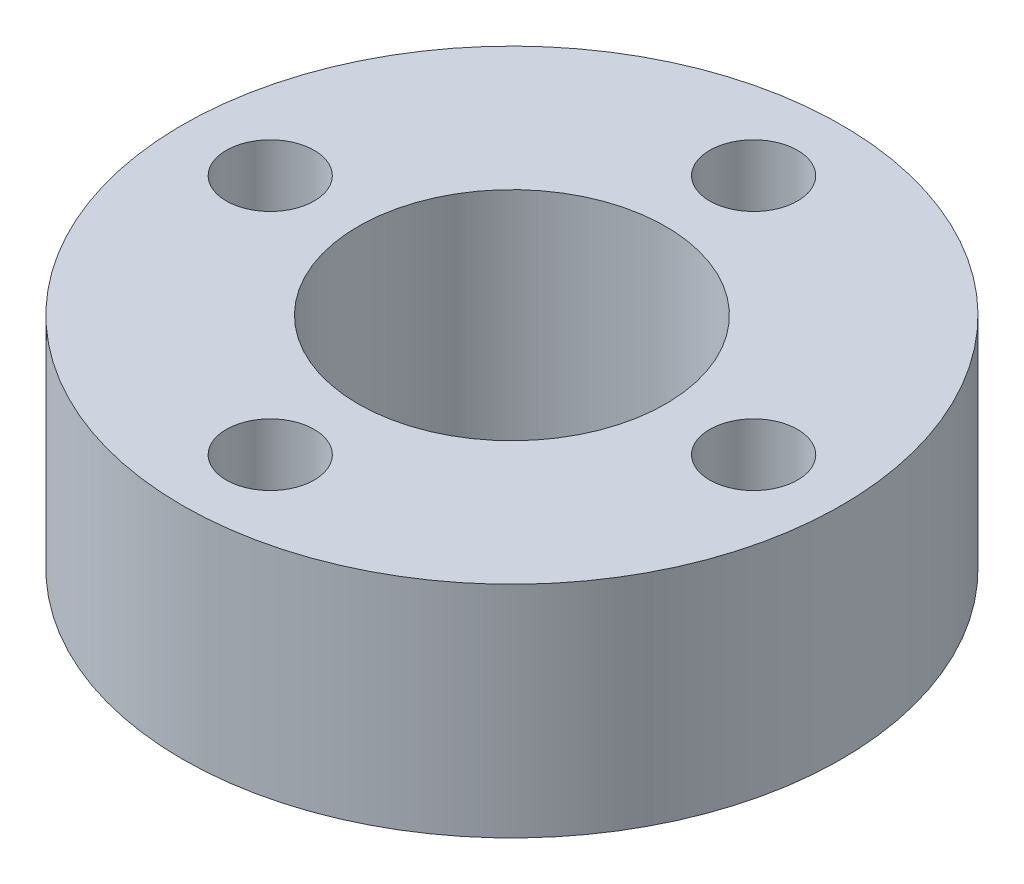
from build123d import *

# Parameters (mm, degrees)
SKETCH1_R      = 15
SKETCH1_R_2    = 7
SKETCH1_R_3    = 2
EXTRUDE1_DEPTH = 10


with BuildPart() as part:
    # Sketch1 → Extrude1 (new body)
    with BuildSketch(Plane(origin=(0, 0, 0), x_dir=(1, 0, 0), z_dir=(0, 1, 0))):
        with Locations(Location((0, 0, 0), (0, 0, 270))):
            Circle(SKETCH1_R)
        with Locations(Location((0, 0, 0), (0, 0, 270))):
            Circle(SKETCH1_R_2, mode=Mode.SUBTRACT)
        with Locations(Location((-11, 0, 0), (0, 0, 270))):
            Circle(SKETCH1_R_3, mode=Mode.SUBTRACT)
        with Locations(Location((0, -11, 0), (0, 0, 270))):
            Circle(SKETCH1_R_3, mode=Mode.SUBTRACT)
        with Locations(Location((0, 11, 0), (0, 0, 270))):
            Circle(SKETCH1_R_3, mode=Mode.SUBTRACT)
        with Locations(Location((11, 0, 0), (0, 0, 270))):
            Circle(SKETCH1_R_3, mode=Mode.SUBTRACT)
    extrude(amount=EXTRUDE1_DEPTH)


solid = part.part
